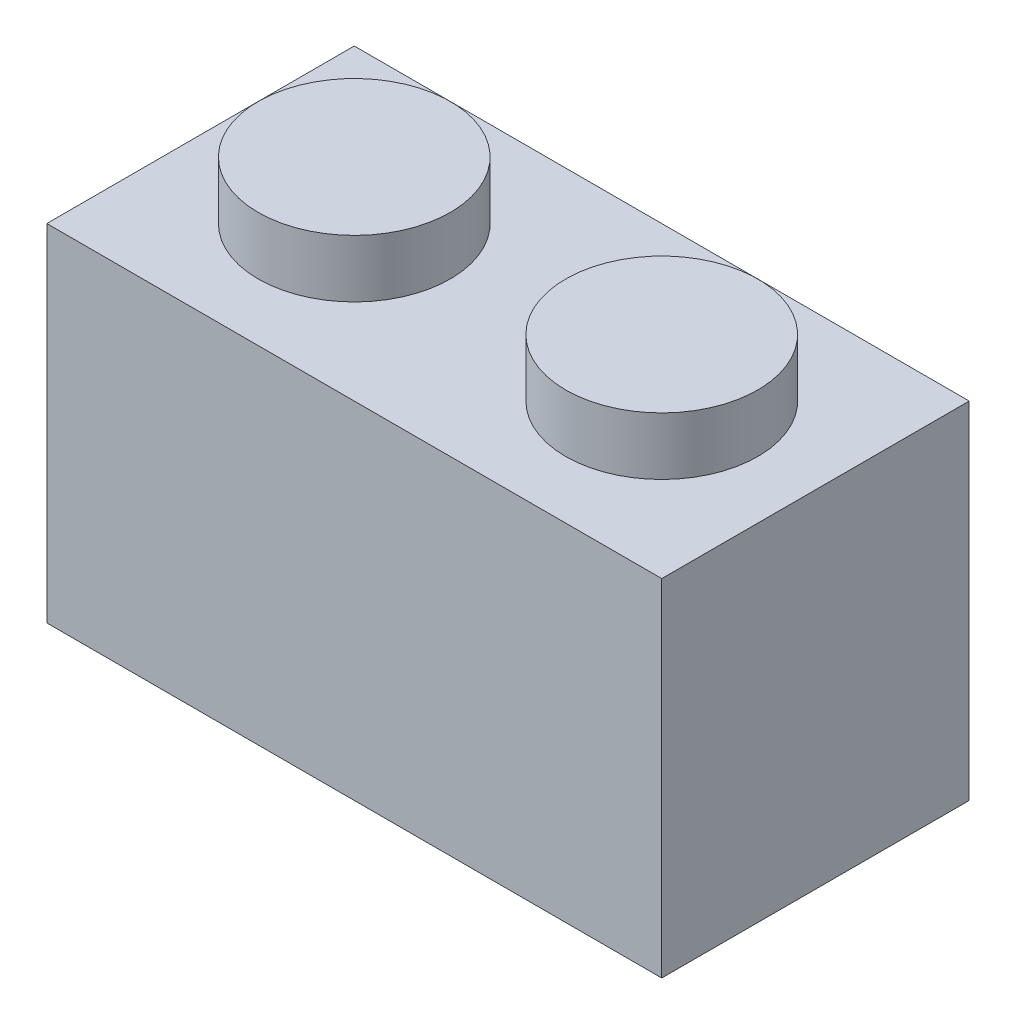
ISO-10303-21;
HEADER;
FILE_DESCRIPTION(('STEP AP214'),'2;1');
FILE_NAME('part.step','',(''),(''),'','','');
FILE_SCHEMA(('AUTOMOTIVE_DESIGN { 1 0 10303 214 1 1 1 1 }'));
ENDSEC;
DATA;
#1=APPLICATION_CONTEXT('core data for automotive mechanical design processes');
#2=APPLICATION_PROTOCOL_DEFINITION('international standard','automotive_design',2000,#1);
#3=PRODUCT_CONTEXT('',#1,'mechanical');
#4=PRODUCT('Part','Part','',(#3));
#5=PRODUCT_RELATED_PRODUCT_CATEGORY('part','',(#4));
#6=PRODUCT_DEFINITION_FORMATION('','',#4);
#7=PRODUCT_DEFINITION_CONTEXT('part definition',#1,'design');
#8=PRODUCT_DEFINITION('design','',#6,#7);
#9=PRODUCT_DEFINITION_SHAPE('','',#8);
#10=(LENGTH_UNIT() NAMED_UNIT(*) SI_UNIT(.MILLI.,.METRE.));
#11=(NAMED_UNIT(*) PLANE_ANGLE_UNIT() SI_UNIT($,.RADIAN.));
#12=(NAMED_UNIT(*) SI_UNIT($,.STERADIAN.) SOLID_ANGLE_UNIT());
#13=UNCERTAINTY_MEASURE_WITH_UNIT(LENGTH_MEASURE(1.E-05),#10,'distance_accuracy_value','');
#14=(GEOMETRIC_REPRESENTATION_CONTEXT(3) GLOBAL_UNCERTAINTY_ASSIGNED_CONTEXT((#13)) GLOBAL_UNIT_ASSIGNED_CONTEXT((#10,
#11,#12)) REPRESENTATION_CONTEXT('',''));
#15=CARTESIAN_POINT('',(0.,0.,0.));
#16=DIRECTION('',(0.,0.,1.));
#17=DIRECTION('',(1.,0.,0.));
#18=AXIS2_PLACEMENT_3D('',#15,#16,#17);
#19=CARTESIAN_POINT('',(0.,0.,8.));
#20=DIRECTION('',(0.,1.,0.));
#21=DIRECTION('',(0.,0.,1.));
#22=AXIS2_PLACEMENT_3D('',#19,#20,#21);
#23=PLANE('',#22);
#24=CARTESIAN_POINT('',(12.,0.,4.));
#25=DIRECTION('',(0.,1.,0.));
#26=DIRECTION('',(0.,0.,1.));
#27=AXIS2_PLACEMENT_3D('',#24,#25,#26);
#28=CIRCLE('',#27,2.5);
#29=CARTESIAN_POINT('',(12.,0.,6.5));
#30=VERTEX_POINT('',#29);
#31=EDGE_CURVE('E241',#30,#30,#28,.T.);
#32=ORIENTED_EDGE('',*,*,#31,.F.);
#33=EDGE_LOOP('',(#32));
#34=FACE_BOUND('',#33,.T.);
#35=DIRECTION('',(0.,0.,1.));
#36=VECTOR('',#35,1.);
#37=CARTESIAN_POINT('',(0.,0.,0.));
#38=LINE('',#37,#36);
#39=CARTESIAN_POINT('',(0.,0.,0.));
#40=VERTEX_POINT('',#39);
#41=CARTESIAN_POINT('',(0.,0.,8.));
#42=VERTEX_POINT('',#41);
#43=EDGE_CURVE('E151',#40,#42,#38,.T.);
#44=ORIENTED_EDGE('',*,*,#43,.T.);
#45=DIRECTION('',(1.,0.,0.));
#46=VECTOR('',#45,1.);
#47=CARTESIAN_POINT('',(0.,0.,8.));
#48=LINE('',#47,#46);
#49=CARTESIAN_POINT('',(16.,0.,8.));
#50=VERTEX_POINT('',#49);
#51=EDGE_CURVE('E154',#42,#50,#48,.T.);
#52=ORIENTED_EDGE('',*,*,#51,.T.);
#53=DIRECTION('',(0.,0.,-1.));
#54=VECTOR('',#53,1.);
#55=CARTESIAN_POINT('',(16.,0.,0.));
#56=LINE('',#55,#54);
#57=CARTESIAN_POINT('',(16.,0.,0.));
#58=VERTEX_POINT('',#57);
#59=EDGE_CURVE('E157',#50,#58,#56,.T.);
#60=ORIENTED_EDGE('',*,*,#59,.T.);
#61=DIRECTION('',(-1.,0.,0.));
#62=VECTOR('',#61,1.);
#63=CARTESIAN_POINT('',(0.,0.,0.));
#64=LINE('',#63,#62);
#65=EDGE_CURVE('E160',#58,#40,#64,.T.);
#66=ORIENTED_EDGE('',*,*,#65,.T.);
#67=EDGE_LOOP('',(#44,#52,#60,#66));
#68=FACE_BOUND('',#67,.T.);
#69=CARTESIAN_POINT('',(4.,0.,4.));
#70=DIRECTION('',(0.,1.,0.));
#71=DIRECTION('',(0.,0.,1.));
#72=AXIS2_PLACEMENT_3D('',#69,#70,#71);
#73=CIRCLE('',#72,2.5);
#74=CARTESIAN_POINT('',(4.,0.,6.5));
#75=VERTEX_POINT('',#74);
#76=EDGE_CURVE('E242',#75,#75,#73,.T.);
#77=ORIENTED_EDGE('',*,*,#76,.F.);
#78=EDGE_LOOP('',(#77));
#79=FACE_BOUND('',#78,.T.);
#80=ADVANCED_FACE('F32',(#34,#68,#79),#23,.T.);
#81=CARTESIAN_POINT('',(0.,-1.,8.));
#82=DIRECTION('',(0.,1.,0.));
#83=DIRECTION('',(0.,0.,1.));
#84=AXIS2_PLACEMENT_3D('',#81,#82,#83);
#85=PLANE('',#84);
#86=DIRECTION('',(-1.,0.,0.));
#87=VECTOR('',#86,1.);
#88=CARTESIAN_POINT('',(1.,-1.,7.));
#89=LINE('',#88,#87);
#90=CARTESIAN_POINT('',(15.,-1.,7.));
#91=VERTEX_POINT('',#90);
#92=CARTESIAN_POINT('',(1.,-1.,7.));
#93=VERTEX_POINT('',#92);
#94=EDGE_CURVE('E107',#91,#93,#89,.T.);
#95=ORIENTED_EDGE('',*,*,#94,.T.);
#96=DIRECTION('',(0.,0.,-1.));
#97=VECTOR('',#96,1.);
#98=CARTESIAN_POINT('',(1.,-1.,0.999999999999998));
#99=LINE('',#98,#97);
#100=CARTESIAN_POINT('',(1.,-1.,0.999999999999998));
#101=VERTEX_POINT('',#100);
#102=EDGE_CURVE('E127',#93,#101,#99,.T.);
#103=ORIENTED_EDGE('',*,*,#102,.T.);
#104=DIRECTION('',(1.,0.,0.));
#105=VECTOR('',#104,1.);
#106=CARTESIAN_POINT('',(1.,-1.,0.999999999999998));
#107=LINE('',#106,#105);
#108=CARTESIAN_POINT('',(15.,-1.,0.999999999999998));
#109=VERTEX_POINT('',#108);
#110=EDGE_CURVE('E113',#101,#109,#107,.T.);
#111=ORIENTED_EDGE('',*,*,#110,.T.);
#112=DIRECTION('',(0.,0.,1.));
#113=VECTOR('',#112,1.);
#114=CARTESIAN_POINT('',(15.,-1.,0.999999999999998));
#115=LINE('',#114,#113);
#116=EDGE_CURVE('E131',#109,#91,#115,.T.);
#117=ORIENTED_EDGE('',*,*,#116,.T.);
#118=EDGE_LOOP('',(#95,#103,#111,#117));
#119=FACE_BOUND('',#118,.T.);
#120=CARTESIAN_POINT('',(8.,-1.,4.));
#121=DIRECTION('',(0.,1.,0.));
#122=DIRECTION('',(0.,0.,1.));
#123=AXIS2_PLACEMENT_3D('',#120,#121,#122);
#124=CIRCLE('',#123,1.5);
#125=CARTESIAN_POINT('',(8.,-1.,5.5));
#126=VERTEX_POINT('',#125);
#127=EDGE_CURVE('E11',#126,#126,#124,.F.);
#128=ORIENTED_EDGE('',*,*,#127,.F.);
#129=EDGE_LOOP('',(#128));
#130=FACE_BOUND('',#129,.T.);
#131=ADVANCED_FACE('F190',(#119,#130),#85,.F.);
#132=CARTESIAN_POINT('',(0.,-1.,0.));
#133=DIRECTION('',(-1.,0.,0.));
#134=DIRECTION('',(0.,0.,1.));
#135=AXIS2_PLACEMENT_3D('',#132,#133,#134);
#136=PLANE('',#135);
#137=ORIENTED_EDGE('',*,*,#43,.F.);
#138=DIRECTION('',(0.,1.,0.));
#139=VECTOR('',#138,1.);
#140=CARTESIAN_POINT('',(0.,-1.,0.));
#141=LINE('',#140,#139);
#142=CARTESIAN_POINT('',(0.,-9.,0.));
#143=VERTEX_POINT('',#142);
#144=EDGE_CURVE('E40',#143,#40,#141,.T.);
#145=ORIENTED_EDGE('',*,*,#144,.F.);
#146=DIRECTION('',(0.,0.,-1.));
#147=VECTOR('',#146,1.);
#148=CARTESIAN_POINT('',(0.,-9.,8.));
#149=LINE('',#148,#147);
#150=CARTESIAN_POINT('',(0.,-9.,8.));
#151=VERTEX_POINT('',#150);
#152=EDGE_CURVE('E145',#151,#143,#149,.T.);
#153=ORIENTED_EDGE('',*,*,#152,.F.);
#154=DIRECTION('',(0.,1.,0.));
#155=VECTOR('',#154,1.);
#156=CARTESIAN_POINT('',(0.,-1.,8.));
#157=LINE('',#156,#155);
#158=EDGE_CURVE('E163',#151,#42,#157,.T.);
#159=ORIENTED_EDGE('',*,*,#158,.T.);
#160=EDGE_LOOP('',(#137,#145,#153,#159));
#161=FACE_BOUND('',#160,.T.);
#162=ADVANCED_FACE('F34',(#161),#136,.T.);
#163=CARTESIAN_POINT('',(0.,-1.,0.));
#164=DIRECTION('',(0.,0.,-1.));
#165=DIRECTION('',(-1.,0.,0.));
#166=AXIS2_PLACEMENT_3D('',#163,#164,#165);
#167=PLANE('',#166);
#168=ORIENTED_EDGE('',*,*,#65,.F.);
#169=DIRECTION('',(0.,1.,0.));
#170=VECTOR('',#169,1.);
#171=CARTESIAN_POINT('',(16.,-1.,0.));
#172=LINE('',#171,#170);
#173=CARTESIAN_POINT('',(16.,-9.,0.));
#174=VERTEX_POINT('',#173);
#175=EDGE_CURVE('E165',#174,#58,#172,.T.);
#176=ORIENTED_EDGE('',*,*,#175,.F.);
#177=DIRECTION('',(1.,0.,0.));
#178=VECTOR('',#177,1.);
#179=CARTESIAN_POINT('',(16.,-9.,0.));
#180=LINE('',#179,#178);
#181=EDGE_CURVE('E148',#143,#174,#180,.T.);
#182=ORIENTED_EDGE('',*,*,#181,.F.);
#183=ORIENTED_EDGE('',*,*,#144,.T.);
#184=EDGE_LOOP('',(#168,#176,#182,#183));
#185=FACE_BOUND('',#184,.T.);
#186=ADVANCED_FACE('F177',(#185),#167,.T.);
#187=CARTESIAN_POINT('',(16.,-1.,0.));
#188=DIRECTION('',(1.,0.,0.));
#189=DIRECTION('',(0.,0.,-1.));
#190=AXIS2_PLACEMENT_3D('',#187,#188,#189);
#191=PLANE('',#190);
#192=ORIENTED_EDGE('',*,*,#59,.F.);
#193=DIRECTION('',(0.,1.,0.));
#194=VECTOR('',#193,1.);
#195=CARTESIAN_POINT('',(16.,-1.,8.));
#196=LINE('',#195,#194);
#197=CARTESIAN_POINT('',(16.,-9.,8.));
#198=VERTEX_POINT('',#197);
#199=EDGE_CURVE('E167',#198,#50,#196,.T.);
#200=ORIENTED_EDGE('',*,*,#199,.F.);
#201=DIRECTION('',(0.,0.,1.));
#202=VECTOR('',#201,1.);
#203=CARTESIAN_POINT('',(16.,-9.,8.));
#204=LINE('',#203,#202);
#205=EDGE_CURVE('E114',#174,#198,#204,.T.);
#206=ORIENTED_EDGE('',*,*,#205,.F.);
#207=ORIENTED_EDGE('',*,*,#175,.T.);
#208=EDGE_LOOP('',(#192,#200,#206,#207));
#209=FACE_BOUND('',#208,.T.);
#210=ADVANCED_FACE('F181',(#209),#191,.T.);
#211=CARTESIAN_POINT('',(0.,-1.,8.));
#212=DIRECTION('',(0.,0.,1.));
#213=DIRECTION('',(1.,0.,0.));
#214=AXIS2_PLACEMENT_3D('',#211,#212,#213);
#215=PLANE('',#214);
#216=ORIENTED_EDGE('',*,*,#51,.F.);
#217=ORIENTED_EDGE('',*,*,#158,.F.);
#218=DIRECTION('',(-1.,0.,0.));
#219=VECTOR('',#218,1.);
#220=CARTESIAN_POINT('',(16.,-9.,8.));
#221=LINE('',#220,#219);
#222=EDGE_CURVE('E142',#198,#151,#221,.T.);
#223=ORIENTED_EDGE('',*,*,#222,.F.);
#224=ORIENTED_EDGE('',*,*,#199,.T.);
#225=EDGE_LOOP('',(#216,#217,#223,#224));
#226=FACE_BOUND('',#225,.T.);
#227=ADVANCED_FACE('F173',(#226),#215,.T.);
#228=CARTESIAN_POINT('',(16.,-9.,0.));
#229=DIRECTION('',(0.,1.,0.));
#230=DIRECTION('',(0.,0.,1.));
#231=AXIS2_PLACEMENT_3D('',#228,#229,#230);
#232=PLANE('',#231);
#233=ORIENTED_EDGE('',*,*,#205,.T.);
#234=ORIENTED_EDGE('',*,*,#222,.T.);
#235=ORIENTED_EDGE('',*,*,#152,.T.);
#236=ORIENTED_EDGE('',*,*,#181,.T.);
#237=EDGE_LOOP('',(#233,#234,#235,#236));
#238=FACE_BOUND('',#237,.T.);
#239=DIRECTION('',(0.,0.,-1.));
#240=VECTOR('',#239,1.);
#241=CARTESIAN_POINT('',(1.,-9.,0.999999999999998));
#242=LINE('',#241,#240);
#243=CARTESIAN_POINT('',(1.,-9.,7.));
#244=VERTEX_POINT('',#243);
#245=CARTESIAN_POINT('',(1.,-9.,0.999999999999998));
#246=VERTEX_POINT('',#245);
#247=EDGE_CURVE('E98',#244,#246,#242,.T.);
#248=ORIENTED_EDGE('',*,*,#247,.F.);
#249=DIRECTION('',(-1.,0.,0.));
#250=VECTOR('',#249,1.);
#251=CARTESIAN_POINT('',(1.,-9.,7.));
#252=LINE('',#251,#250);
#253=CARTESIAN_POINT('',(15.,-9.,7.));
#254=VERTEX_POINT('',#253);
#255=EDGE_CURVE('E122',#254,#244,#252,.T.);
#256=ORIENTED_EDGE('',*,*,#255,.F.);
#257=DIRECTION('',(0.,0.,1.));
#258=VECTOR('',#257,1.);
#259=CARTESIAN_POINT('',(15.,-9.,0.999999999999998));
#260=LINE('',#259,#258);
#261=CARTESIAN_POINT('',(15.,-9.,0.999999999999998));
#262=VERTEX_POINT('',#261);
#263=EDGE_CURVE('E120',#262,#254,#260,.T.);
#264=ORIENTED_EDGE('',*,*,#263,.F.);
#265=DIRECTION('',(1.,0.,0.));
#266=VECTOR('',#265,1.);
#267=CARTESIAN_POINT('',(1.,-9.,0.999999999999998));
#268=LINE('',#267,#266);
#269=EDGE_CURVE('E106',#246,#262,#268,.T.);
#270=ORIENTED_EDGE('',*,*,#269,.F.);
#271=EDGE_LOOP('',(#248,#256,#264,#270));
#272=FACE_BOUND('',#271,.T.);
#273=ADVANCED_FACE('F118',(#238,#272),#232,.F.);
#274=CARTESIAN_POINT('',(1.,-9.,0.999999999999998));
#275=DIRECTION('',(1.,0.,0.));
#276=DIRECTION('',(0.,0.,-1.));
#277=AXIS2_PLACEMENT_3D('',#274,#275,#276);
#278=PLANE('',#277);
#279=ORIENTED_EDGE('',*,*,#102,.F.);
#280=DIRECTION('',(0.,1.,0.));
#281=VECTOR('',#280,1.);
#282=CARTESIAN_POINT('',(1.,-9.,7.));
#283=LINE('',#282,#281);
#284=EDGE_CURVE('E47',#244,#93,#283,.T.);
#285=ORIENTED_EDGE('',*,*,#284,.F.);
#286=ORIENTED_EDGE('',*,*,#247,.T.);
#287=DIRECTION('',(0.,1.,0.));
#288=VECTOR('',#287,1.);
#289=CARTESIAN_POINT('',(1.,-9.,0.999999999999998));
#290=LINE('',#289,#288);
#291=EDGE_CURVE('E101',#246,#101,#290,.T.);
#292=ORIENTED_EDGE('',*,*,#291,.T.);
#293=EDGE_LOOP('',(#279,#285,#286,#292));
#294=FACE_BOUND('',#293,.T.);
#295=ADVANCED_FACE('F100',(#294),#278,.T.);
#296=CARTESIAN_POINT('',(1.,-9.,0.999999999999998));
#297=DIRECTION('',(0.,0.,1.));
#298=DIRECTION('',(1.,0.,0.));
#299=AXIS2_PLACEMENT_3D('',#296,#297,#298);
#300=PLANE('',#299);
#301=ORIENTED_EDGE('',*,*,#110,.F.);
#302=ORIENTED_EDGE('',*,*,#291,.F.);
#303=ORIENTED_EDGE('',*,*,#269,.T.);
#304=DIRECTION('',(0.,1.,0.));
#305=VECTOR('',#304,1.);
#306=CARTESIAN_POINT('',(15.,-9.,0.999999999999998));
#307=LINE('',#306,#305);
#308=EDGE_CURVE('E115',#262,#109,#307,.T.);
#309=ORIENTED_EDGE('',*,*,#308,.T.);
#310=EDGE_LOOP('',(#301,#302,#303,#309));
#311=FACE_BOUND('',#310,.T.);
#312=ADVANCED_FACE('F110',(#311),#300,.T.);
#313=CARTESIAN_POINT('',(15.,-9.,0.999999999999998));
#314=DIRECTION('',(-1.,0.,0.));
#315=DIRECTION('',(0.,0.,1.));
#316=AXIS2_PLACEMENT_3D('',#313,#314,#315);
#317=PLANE('',#316);
#318=ORIENTED_EDGE('',*,*,#116,.F.);
#319=ORIENTED_EDGE('',*,*,#308,.F.);
#320=ORIENTED_EDGE('',*,*,#263,.T.);
#321=DIRECTION('',(0.,1.,0.));
#322=VECTOR('',#321,1.);
#323=CARTESIAN_POINT('',(15.,-9.,7.));
#324=LINE('',#323,#322);
#325=EDGE_CURVE('E137',#254,#91,#324,.T.);
#326=ORIENTED_EDGE('',*,*,#325,.T.);
#327=EDGE_LOOP('',(#318,#319,#320,#326));
#328=FACE_BOUND('',#327,.T.);
#329=ADVANCED_FACE('F206',(#328),#317,.T.);
#330=CARTESIAN_POINT('',(1.,-9.,7.));
#331=DIRECTION('',(0.,0.,-1.));
#332=DIRECTION('',(-1.,0.,0.));
#333=AXIS2_PLACEMENT_3D('',#330,#331,#332);
#334=PLANE('',#333);
#335=ORIENTED_EDGE('',*,*,#94,.F.);
#336=ORIENTED_EDGE('',*,*,#325,.F.);
#337=ORIENTED_EDGE('',*,*,#255,.T.);
#338=ORIENTED_EDGE('',*,*,#284,.T.);
#339=EDGE_LOOP('',(#335,#336,#337,#338));
#340=FACE_BOUND('',#339,.T.);
#341=ADVANCED_FACE('F209',(#340),#334,.T.);
#342=CARTESIAN_POINT('',(8.,-9.,4.));
#343=DIRECTION('',(0.,1.,0.));
#344=DIRECTION('',(0.,0.,1.));
#345=AXIS2_PLACEMENT_3D('',#342,#343,#344);
#346=CYLINDRICAL_SURFACE('',#345,1.5);
#347=CARTESIAN_POINT('',(8.,-9.,4.));
#348=DIRECTION('',(0.,-1.,0.));
#349=DIRECTION('',(0.,0.,-1.));
#350=AXIS2_PLACEMENT_3D('',#347,#348,#349);
#351=CIRCLE('',#350,1.5);
#352=CARTESIAN_POINT('',(8.,-9.,2.5));
#353=VERTEX_POINT('',#352);
#354=EDGE_CURVE('E129',#353,#353,#351,.T.);
#355=ORIENTED_EDGE('',*,*,#354,.F.);
#356=EDGE_LOOP('',(#355));
#357=FACE_BOUND('',#356,.T.);
#358=ORIENTED_EDGE('',*,*,#127,.T.);
#359=EDGE_LOOP('',(#358));
#360=FACE_BOUND('',#359,.T.);
#361=ADVANCED_FACE('F213',(#357,#360),#346,.T.);
#362=CARTESIAN_POINT('',(8.,-9.,4.));
#363=DIRECTION('',(0.,-1.,0.));
#364=DIRECTION('',(0.,0.,-1.));
#365=AXIS2_PLACEMENT_3D('',#362,#363,#364);
#366=PLANE('',#365);
#367=ORIENTED_EDGE('',*,*,#354,.T.);
#368=EDGE_LOOP('',(#367));
#369=FACE_BOUND('',#368,.T.);
#370=ADVANCED_FACE('F216',(#369),#366,.T.);
#371=CARTESIAN_POINT('',(12.,1.5,4.));
#372=DIRECTION('',(0.,-1.,0.));
#373=DIRECTION('',(0.,0.,-1.));
#374=AXIS2_PLACEMENT_3D('',#371,#372,#373);
#375=CYLINDRICAL_SURFACE('',#374,2.5);
#376=CARTESIAN_POINT('',(12.,1.5,4.));
#377=DIRECTION('',(0.,1.,0.));
#378=DIRECTION('',(0.,0.,1.));
#379=AXIS2_PLACEMENT_3D('',#376,#377,#378);
#380=CIRCLE('',#379,2.5);
#381=CARTESIAN_POINT('',(12.,1.5,6.5));
#382=VERTEX_POINT('',#381);
#383=EDGE_CURVE('E245',#382,#382,#380,.T.);
#384=ORIENTED_EDGE('',*,*,#383,.F.);
#385=EDGE_LOOP('',(#384));
#386=FACE_BOUND('',#385,.T.);
#387=ORIENTED_EDGE('',*,*,#31,.T.);
#388=EDGE_LOOP('',(#387));
#389=FACE_BOUND('',#388,.T.);
#390=ADVANCED_FACE('F220',(#386,#389),#375,.T.);
#391=CARTESIAN_POINT('',(12.,1.5,4.));
#392=DIRECTION('',(0.,1.,0.));
#393=DIRECTION('',(0.,0.,1.));
#394=AXIS2_PLACEMENT_3D('',#391,#392,#393);
#395=PLANE('',#394);
#396=ORIENTED_EDGE('',*,*,#383,.T.);
#397=EDGE_LOOP('',(#396));
#398=FACE_BOUND('',#397,.T.);
#399=ADVANCED_FACE('F224',(#398),#395,.T.);
#400=CARTESIAN_POINT('',(4.,1.5,4.));
#401=DIRECTION('',(0.,-1.,0.));
#402=DIRECTION('',(0.,0.,-1.));
#403=AXIS2_PLACEMENT_3D('',#400,#401,#402);
#404=CYLINDRICAL_SURFACE('',#403,2.5);
#405=CARTESIAN_POINT('',(4.,1.5,4.));
#406=DIRECTION('',(0.,1.,0.));
#407=DIRECTION('',(0.,0.,1.));
#408=AXIS2_PLACEMENT_3D('',#405,#406,#407);
#409=CIRCLE('',#408,2.5);
#410=CARTESIAN_POINT('',(4.,1.5,6.5));
#411=VERTEX_POINT('',#410);
#412=EDGE_CURVE('E240',#411,#411,#409,.T.);
#413=ORIENTED_EDGE('',*,*,#412,.F.);
#414=EDGE_LOOP('',(#413));
#415=FACE_BOUND('',#414,.T.);
#416=ORIENTED_EDGE('',*,*,#76,.T.);
#417=EDGE_LOOP('',(#416));
#418=FACE_BOUND('',#417,.T.);
#419=ADVANCED_FACE('F228',(#415,#418),#404,.T.);
#420=CARTESIAN_POINT('',(4.,1.5,4.));
#421=DIRECTION('',(0.,1.,0.));
#422=DIRECTION('',(0.,0.,1.));
#423=AXIS2_PLACEMENT_3D('',#420,#421,#422);
#424=PLANE('',#423);
#425=ORIENTED_EDGE('',*,*,#412,.T.);
#426=EDGE_LOOP('',(#425));
#427=FACE_BOUND('',#426,.T.);
#428=ADVANCED_FACE('F232',(#427),#424,.T.);
#429=CLOSED_SHELL('',(#80,#131,#162,#186,#210,#227,#273,#295,#312,#329,#341,#361,#370,#390,#399,
#419,#428));
#430=MANIFOLD_SOLID_BREP('B2',#429);
#431=ADVANCED_BREP_SHAPE_REPRESENTATION('',(#18,#430),#14);
#432=SHAPE_DEFINITION_REPRESENTATION(#9,#431);
ENDSEC;
END-ISO-10303-21;
